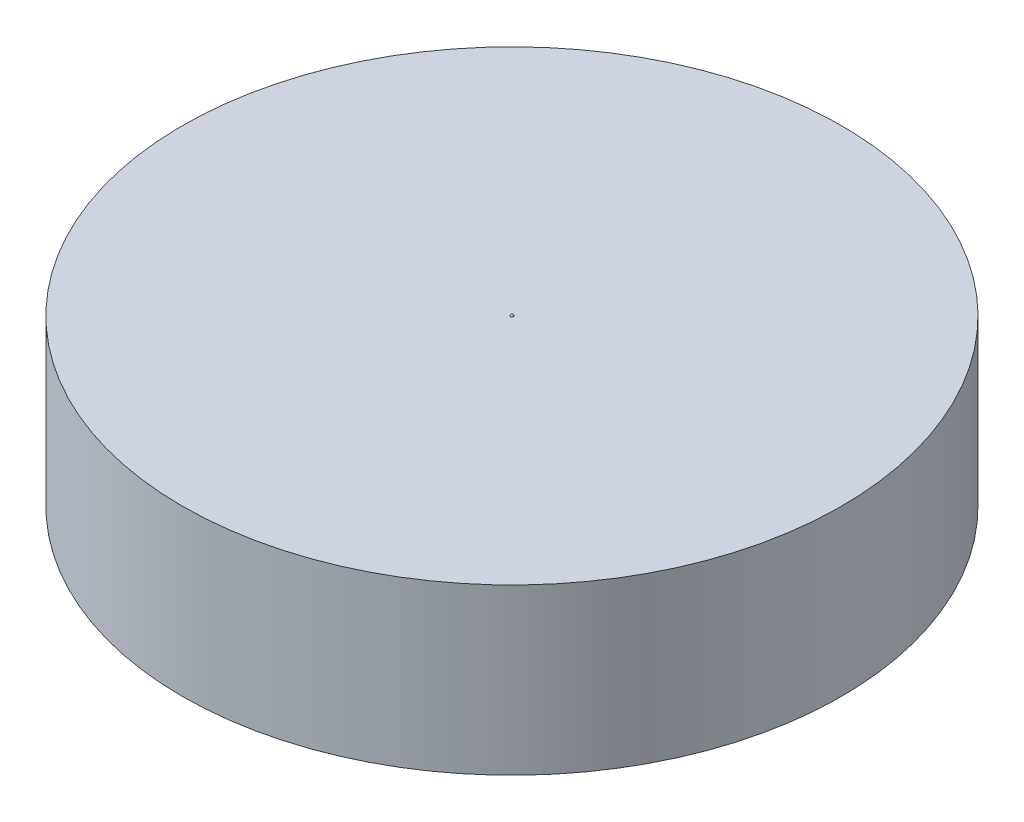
from build123d import *

# Parameters (mm, degrees)
SKIZZE1_R               = 6
LINEAR_AUSTRAGEN1_DEPTH = 3


with BuildPart() as part:
    # Skizze1 → Linear austragen1 (new body)
    with BuildSketch(Plane(origin=(0, 0, 0), x_dir=(1, 0, 0), z_dir=(0, 1, 0))):
        with Locations(Location((0, 0, 0), (0, 0, 270))):
            Circle(SKIZZE1_R)
    extrude(amount=-LINEAR_AUSTRAGEN1_DEPTH)

    # Skizze2 → Rotation1 (revolve)
    with BuildSketch(Plane.XY):
        with BuildLine():
            Line((0, 0), (0, 0.025))
            ThreePointArc((0, 0.025), (0.01767767, 0.01767767), (0.025, 0))
            Line((0.025, 0), (0, 0))
        make_face()
    revolve(axis=Axis((0, 0, 0), (0, 1, 0)))


solid = part.part
